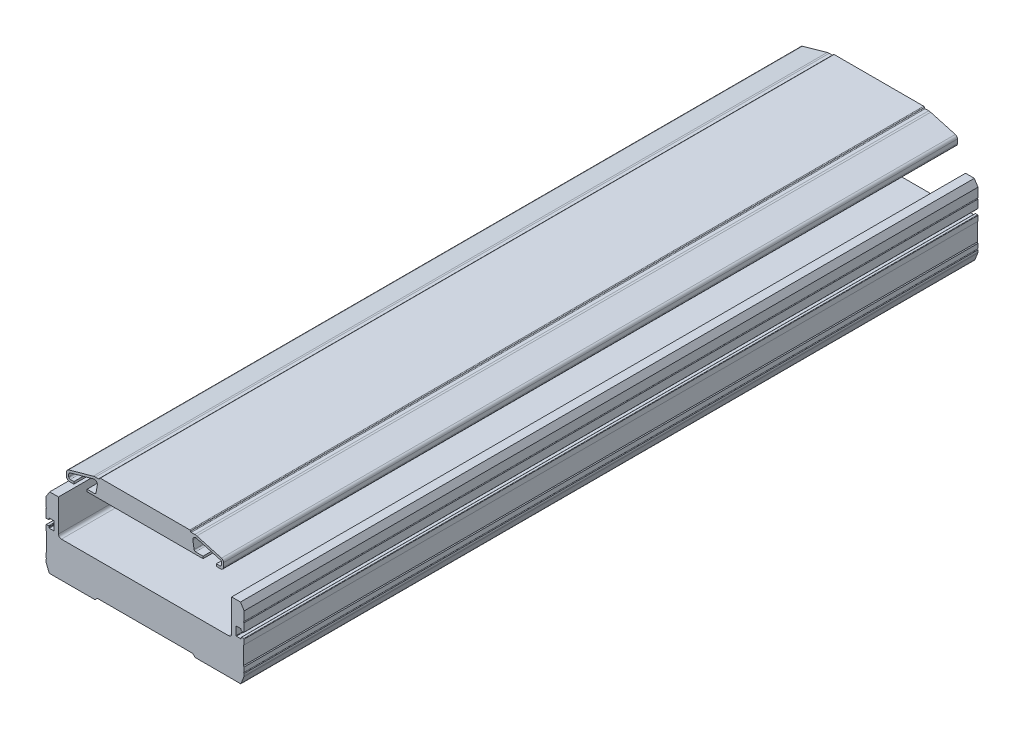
from build123d import *

# Parameters (mm, degrees)
EXTRUDE_1_DEPTH             = 500
EXTRUDE_1_2_DEPTH           = 500
HOLE_WIZARD_1_AT_2_COUNT    = 2
HOLE_WIZARD_1_AT_2_PITCH    = 100
HOLE_WIZARD_1_AT_3_COUNT    = 2
HOLE_WIZARD_1_AT_3_PITCH    = 300
HOLE_WIZARD_1_AT_4_COUNT    = 2
HOLE_WIZARD_1_AT_4_PITCH    = 318.176051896
HOLE_WIZARD_1_AT_5_COUNT    = 2
HOLE_WIZARD_1_AT_5_PITCH    = 145.725769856
HOLE_WIZARD_1_AT_6_COUNT    = 2
HOLE_WIZARD_1_AT_6_PITCH    = 106
HOLE_WIZARD_M6_1_AT_2_COUNT = 2
HOLE_WIZARD_M6_1_AT_2_PITCH = 106
HOLE_WIZARD_M6_1_AT_3_COUNT = 2
HOLE_WIZARD_M6_1_AT_3_PITCH = 100
HOLE_WIZARD_M6_1_AT_4_COUNT = 2
HOLE_WIZARD_M6_1_AT_4_PITCH = 300
HOLE_WIZARD_M6_1_AT_5_COUNT = 2
HOLE_WIZARD_M6_1_AT_5_PITCH = 318.176051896
HOLE_WIZARD_M6_1_AT_6_COUNT = 2
HOLE_WIZARD_M6_1_AT_6_PITCH = 145.725769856


with BuildPart() as part:
    # Sketch 1 → Extrude 1 (new body)
    with BuildSketch(Plane.XY):
        with BuildLine():
            Line((30.499999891, 71.899999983), (-30.500000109, 71.899999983))
            ThreePointArc((-30.500000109, 71.899999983), (-30.853553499, 71.753553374), (-31.000000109, 71.399999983))
            ThreePointArc((-31.000000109, 71.399999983), (-31.146446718, 71.046446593), (-31.500000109, 70.899999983))
            Line((-31.500000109, 70.899999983), (-33.912207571, 70.899999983))
            ThreePointArc((-33.912207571, 70.899999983), (-34.593583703, 70.853355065), (-35.262246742, 70.71429061))
            Line((-35.262246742, 70.71429061), (-52.040015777, 66.009413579))
            ThreePointArc((-52.040015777, 66.009413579), (-53.093742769, 65.291995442), (-53.500000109, 64.083697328))
            Line((-53.500000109, 64.083697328), (-53.500000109, 61.399999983))
            ThreePointArc((-53.500000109, 61.399999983), (-52.914213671, 59.985786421), (-51.500000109, 59.399999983))
            Line((-51.500000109, 59.399999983), (-48.500000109, 59.399999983))
            Line((-48.500000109, 59.399999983), (-48.500000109, 60.899999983))
            Line((-48.500000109, 60.899999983), (-51.000000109, 60.899999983))
            ThreePointArc((-51.000000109, 60.899999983), (-51.70710689, 61.192893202), (-52.000000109, 61.899999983))
            Line((-52.000000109, 61.899999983), (-52.000000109, 63.704621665))
            ThreePointArc((-52.000000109, 63.704621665), (-51.796871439, 64.308770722), (-51.270007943, 64.66747979))
            Line((-51.270007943, 64.66747979), (-35.048529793, 69.216359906))
            ThreePointArc((-35.048529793, 69.216359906), (-33.171932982, 68.778444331), (-32.536146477, 66.95933434))
            Line((-32.536146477, 66.95933434), (-33.413816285, 61.734345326))
            ThreePointArc((-33.413816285, 61.734345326), (-33.754111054, 61.136568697), (-34.400000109, 60.899999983))
            Line((-34.400000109, 60.899999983), (-39.500000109, 60.899999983))
            Line((-39.500000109, 60.899999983), (-39.500000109, 59.399999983))
            Line((-39.500000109, 59.399999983), (39.499999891, 59.399999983))
            Line((39.499999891, 59.399999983), (39.499999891, 60.899999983))
            Line((39.499999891, 60.899999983), (34.399999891, 60.899999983))
            ThreePointArc((34.399999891, 60.899999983), (33.754110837, 61.136568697), (33.413816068, 61.734345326))
            Line((33.413816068, 61.734345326), (32.53614626, 66.95933434))
            ThreePointArc((32.53614626, 66.95933434), (33.171932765, 68.778444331), (35.048529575, 69.216359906))
            Line((35.048529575, 69.216359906), (51.270007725, 64.66747979))
            ThreePointArc((51.270007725, 64.66747979), (51.796871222, 64.308770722), (51.999999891, 63.704621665))
            Line((51.999999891, 63.704621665), (51.999999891, 61.899999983))
            ThreePointArc((51.999999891, 61.899999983), (51.707106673, 61.192893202), (50.999999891, 60.899999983))
            Line((50.999999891, 60.899999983), (48.499999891, 60.899999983))
            Line((48.499999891, 60.899999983), (48.499999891, 59.399999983))
            Line((48.499999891, 59.399999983), (51.499999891, 59.399999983))
            ThreePointArc((51.499999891, 59.399999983), (52.914213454, 59.985786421), (53.499999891, 61.399999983))
            Line((53.499999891, 61.399999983), (53.499999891, 64.083697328))
            ThreePointArc((53.499999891, 64.083697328), (53.093742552, 65.291995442), (52.04001556, 66.009413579))
            Line((52.04001556, 66.009413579), (35.262246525, 70.71429061))
            ThreePointArc((35.262246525, 70.71429061), (34.593583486, 70.853355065), (33.912207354, 70.899999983))
            Line((33.912207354, 70.899999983), (31.499999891, 70.899999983))
            ThreePointArc((31.499999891, 70.899999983), (31.146446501, 71.046446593), (30.999999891, 71.399999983))
            ThreePointArc((30.999999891, 71.399999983), (30.853553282, 71.753553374), (30.499999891, 71.899999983))
        make_face()
    extrude(amount=EXTRUDE_1_DEPTH)


with BuildPart() as body_2:
    # Sketch 1 → Extrude 1 2 (new body)
    with BuildSketch(Plane.XY):
        with BuildLine():
            Line((56.999999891, 22.699999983), (-57.000000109, 22.699999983))
            ThreePointArc((-57.000000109, 22.699999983), (-58.414213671, 23.285786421), (-59.000000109, 24.699999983))
            Line((-59.000000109, 24.699999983), (-59.000000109, 46.599999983))
            Line((-59.000000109, 46.599999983), (-65.000000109, 46.599999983))
            Line((-65.000000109, 46.599999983), (-67.500000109, 42.599999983))
            Line((-67.500000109, 42.599999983), (-67.500000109, 36.374999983))
            ThreePointArc((-67.500000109, 36.374999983), (-67.125000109, 35.999999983), (-67.500000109, 35.624999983))
            Line((-67.500000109, 35.624999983), (-67.500000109, 30.099999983))
            ThreePointArc((-67.500000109, 30.099999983), (-67.412132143, 29.887867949), (-67.200000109, 29.799999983))
            Line((-67.200000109, 29.799999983), (-65.800000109, 29.799999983))
            ThreePointArc((-65.800000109, 29.799999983), (-65.587868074, 29.887867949), (-65.500000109, 30.099999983))
            Line((-65.500000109, 30.099999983), (-65.500000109, 30.699999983))
            ThreePointArc((-65.500000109, 30.699999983), (-65.412132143, 30.912132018), (-65.200000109, 30.999999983))
            Line((-65.200000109, 30.999999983), (-62.300000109, 30.999999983))
            ThreePointArc((-62.300000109, 30.999999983), (-62.087868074, 30.912132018), (-62.000000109, 30.699999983))
            Line((-62.000000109, 30.699999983), (-62.000000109, 25.299999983))
            ThreePointArc((-62.000000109, 25.299999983), (-62.087868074, 25.087867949), (-62.300000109, 24.999999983))
            Line((-62.300000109, 24.999999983), (-65.200000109, 24.999999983))
            ThreePointArc((-65.200000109, 24.999999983), (-65.412132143, 25.087867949), (-65.500000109, 25.299999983))
            Line((-65.500000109, 25.299999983), (-65.500000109, 25.899999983))
            ThreePointArc((-65.500000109, 25.899999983), (-65.587868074, 26.112132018), (-65.800000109, 26.199999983))
            Line((-65.800000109, 26.199999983), (-67.200000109, 26.199999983))
            ThreePointArc((-67.200000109, 26.199999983), (-67.412132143, 26.112132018), (-67.500000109, 25.899999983))
            Line((-67.500000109, 25.899999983), (-67.500000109, 22.499999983))
            Line((-67.500000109, 22.499999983), (-67.000000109, 21.999999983))
            Line((-67.000000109, 21.999999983), (-67.000000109, 9.999999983))
            Line((-67.000000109, 9.999999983), (-67.500000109, 9.499999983))
            Line((-67.500000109, 9.499999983), (-67.500000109, 6.374999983))
            ThreePointArc((-67.500000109, 6.374999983), (-67.125000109, 5.999999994), (-67.500000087, 5.624999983))
            Line((-67.500000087, 5.624999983), (-67.500000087, 4.381968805))
            ThreePointArc((-67.500000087, 4.381968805), (-67.464652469, 4.007614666), (-67.359859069, 3.646493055))
            Line((-67.359859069, 3.646493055), (-65.506419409, -1.028851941))
            ThreePointArc((-65.506419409, -1.028851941), (-65.357223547, -1.328991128), (-65.16, -1.6))
            Line((-65.16, -1.6), (-34.1, -1.6))
            Line((-34.1, -1.6), (-32.5, 0))
            Line((-32.5, 0), (32.5, 0))
            Line((32.5, 0), (34.1, -1.6))
            Line((34.1, -1.6), (65.16, -1.6))
            ThreePointArc((65.16, -1.6), (65.35722363, -1.328990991), (65.506419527, -1.028851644))
            Line((65.506419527, -1.028851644), (67.360357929, 3.647753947))
            ThreePointArc((67.360357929, 3.647753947), (67.464713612, 4.007932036), (67.500000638, 4.381259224))
            Line((67.500000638, 4.381259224), (67.500000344, 5.624999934))
            ThreePointArc((67.500000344, 5.624999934), (67.125000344, 5.999999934), (67.500000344, 6.374999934))
            Line((67.500000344, 6.374999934), (67.500000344, 9.499999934))
            Line((67.500000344, 9.499999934), (67.000000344, 9.999999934))
            Line((67.000000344, 9.999999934), (67.000000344, 21.999999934))
            Line((67.000000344, 21.999999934), (67.500000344, 22.499999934))
            Line((67.500000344, 22.499999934), (67.500000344, 25.899999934))
            ThreePointArc((67.500000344, 25.899999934), (67.412132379, 26.112131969), (67.200000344, 26.199999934))
            Line((67.200000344, 26.199999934), (65.800000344, 26.199999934))
            ThreePointArc((65.800000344, 26.199999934), (65.58786831, 26.112131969), (65.500000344, 25.899999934))
            Line((65.500000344, 25.899999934), (65.500000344, 25.299999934))
            ThreePointArc((65.500000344, 25.299999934), (65.412132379, 25.0878679), (65.200000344, 24.999999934))
            Line((65.200000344, 24.999999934), (62.300000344, 24.999999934))
            ThreePointArc((62.300000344, 24.999999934), (62.08786831, 25.0878679), (62.000000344, 25.299999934))
            Line((62.000000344, 25.299999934), (62.000000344, 30.699999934))
            ThreePointArc((62.000000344, 30.699999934), (62.08786831, 30.912131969), (62.300000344, 30.999999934))
            Line((62.300000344, 30.999999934), (65.200000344, 30.999999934))
            ThreePointArc((65.200000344, 30.999999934), (65.412132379, 30.912131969), (65.500000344, 30.699999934))
            Line((65.500000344, 30.699999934), (65.500000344, 30.099999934))
            ThreePointArc((65.500000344, 30.099999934), (65.58786831, 29.8878679), (65.800000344, 29.799999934))
            Line((65.800000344, 29.799999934), (67.200000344, 29.799999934))
            ThreePointArc((67.200000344, 29.799999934), (67.412132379, 29.8878679), (67.500000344, 30.099999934))
            Line((67.500000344, 30.099999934), (67.500000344, 35.624999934))
            ThreePointArc((67.500000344, 35.624999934), (67.125000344, 35.999999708), (67.499999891, 36.374999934))
            Line((67.499999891, 36.374999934), (67.499999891, 42.599999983))
            Line((67.499999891, 42.599999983), (64.999999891, 46.599999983))
            Line((64.999999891, 46.599999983), (58.999999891, 46.599999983))
            Line((58.999999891, 46.599999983), (58.999999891, 24.699999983))
            ThreePointArc((58.999999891, 24.699999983), (58.414213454, 23.285786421), (56.999999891, 22.699999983))
        make_face()
    extrude(amount=EXTRUDE_1_2_DEPTH)

    # Sketch 5 → Hole Wizard 1 (revolve, cut)
    with BuildSketch(Plane(origin=(-53, 46.599999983, 61.5), x_dir=(0, 0, 1), z_dir=(1, 0, 0))):
        Polygon((0, 0), (0, 48.199999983), (3.5, 48.199999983), (3.5, 40.9), (5.5, 40.9), (5.5, 0), align=None)
    hole_wizard_1 = revolve(axis=Axis((-53, 52.949999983, 61.5), (0, -1, 0)), mode=Mode.SUBTRACT)

    # Hole Wizard 1 at 2: Hole Wizard 1 ×2
    with Locations(*[(0, 0, i * HOLE_WIZARD_1_AT_2_PITCH) for i in range(1, HOLE_WIZARD_1_AT_2_COUNT)]):
        add(hole_wizard_1, mode=Mode.SUBTRACT)

    # Hole Wizard 1 at 3: Hole Wizard 1 ×2
    with Locations(*[(0, 0, i * HOLE_WIZARD_1_AT_3_PITCH) for i in range(1, HOLE_WIZARD_1_AT_3_COUNT)]):
        add(hole_wizard_1, mode=Mode.SUBTRACT)

    # Hole Wizard 1 at 4: Hole Wizard 1 ×2
    with Locations(*[Vector(0.3331488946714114, 0, 0.9428742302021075) * (i * HOLE_WIZARD_1_AT_4_PITCH) for i in range(1, HOLE_WIZARD_1_AT_4_COUNT)]):
        add(hole_wizard_1, mode=Mode.SUBTRACT)

    # Hole Wizard 1 at 5: Hole Wizard 1 ×2
    with Locations(*[Vector(0.7273936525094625, 0, 0.6862204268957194) * (i * HOLE_WIZARD_1_AT_5_PITCH) for i in range(1, HOLE_WIZARD_1_AT_5_COUNT)]):
        add(hole_wizard_1, mode=Mode.SUBTRACT)

    # Hole Wizard 1 at 6: Hole Wizard 1 ×2
    with Locations(*[(i * HOLE_WIZARD_1_AT_6_PITCH, 0, 0) for i in range(1, HOLE_WIZARD_1_AT_6_COUNT)]):
        add(hole_wizard_1, mode=Mode.SUBTRACT)

    # Sketch 9 → Hole Wizard M6 _1 (revolve, cut)
    with BuildSketch(Plane(origin=(53, -1.6, 51.5), x_dir=(0, 0, -1), z_dir=(1, 0, 0))):
        Polygon((0, 0), (0, 12.502151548), (2.5, 11), (2.5, 0), align=None)
    hole_wizard_m6_1 = revolve(axis=Axis((53, -7.95, 51.5), (0, 1, 0)), mode=Mode.SUBTRACT)

    # Hole Wizard M6 _1 at 2: Hole Wizard M6 _1 ×2
    with Locations(*[(-i * HOLE_WIZARD_M6_1_AT_2_PITCH, 0, 0) for i in range(1, HOLE_WIZARD_M6_1_AT_2_COUNT)]):
        add(hole_wizard_m6_1, mode=Mode.SUBTRACT)

    # Hole Wizard M6 _1 at 3: Hole Wizard M6 _1 ×2
    with Locations(*[(0, 0, i * HOLE_WIZARD_M6_1_AT_3_PITCH) for i in range(1, HOLE_WIZARD_M6_1_AT_3_COUNT)]):
        add(hole_wizard_m6_1, mode=Mode.SUBTRACT)

    # Hole Wizard M6 _1 at 4: Hole Wizard M6 _1 ×2
    with Locations(*[(0, 0, i * HOLE_WIZARD_M6_1_AT_4_PITCH) for i in range(1, HOLE_WIZARD_M6_1_AT_4_COUNT)]):
        add(hole_wizard_m6_1, mode=Mode.SUBTRACT)

    # Hole Wizard M6 _1 at 5: Hole Wizard M6 _1 ×2
    with Locations(*[Vector(-0.33314889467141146, 0, 0.9428742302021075) * (i * HOLE_WIZARD_M6_1_AT_5_PITCH) for i in range(1, HOLE_WIZARD_M6_1_AT_5_COUNT)]):
        add(hole_wizard_m6_1, mode=Mode.SUBTRACT)

    # Hole Wizard M6 _1 at 6: Hole Wizard M6 _1 ×2
    with Locations(*[Vector(-0.7273936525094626, 0, 0.6862204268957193) * (i * HOLE_WIZARD_M6_1_AT_6_PITCH) for i in range(1, HOLE_WIZARD_M6_1_AT_6_COUNT)]):
        add(hole_wizard_m6_1, mode=Mode.SUBTRACT)


solid = Compound([part.part, body_2.part])
